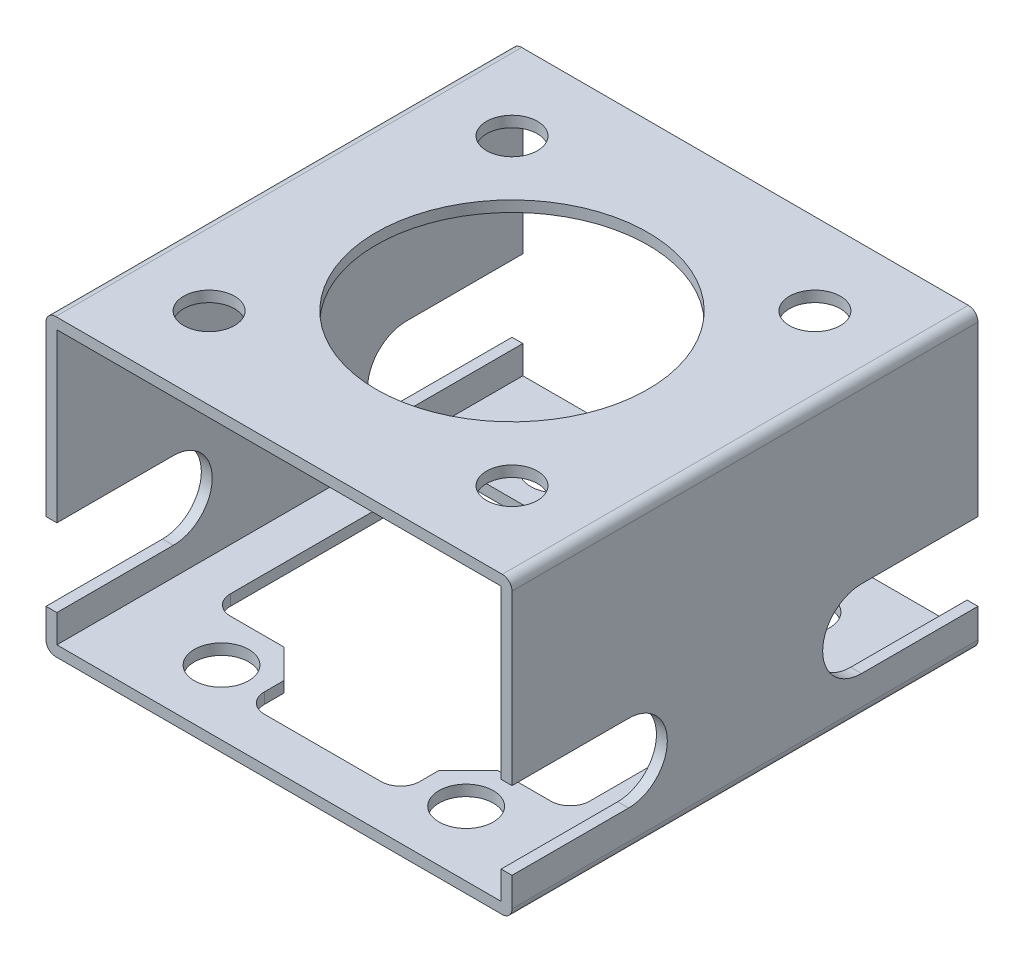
from build123d import *

# Parameters (mm, degrees)
SKETCH1_W          = 72.644
SKETCH1_H          = 44.6278
EXTRUDE1_DEPTH     = 38.1
CUT_EXTRUDE4_DEPTH = 98.876087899
SKETCH3_R          = 22.225
SKETCH3_R_2        = 4.1656
CUT_EXTRUDE5_DEPTH = 1.778
SKETCH4_R          = 4.445
CUT_EXTRUDE6_DEPTH = 1.778
CUT_EXTRUDE7_DEPTH = 1.778
FILLET1_R          = 3.175


with BuildPart() as part:
    # Sketch1 → Extrude1 (new, symmetric)
    with BuildSketch(Plane.XY):
        with BuildLine():
            Line((1.5875, 0), (74.6125, 0))
            ThreePointArc((74.6125, 0), (75.735032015, 0.464967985), (76.2, 1.5875))
            Line((76.2, 1.5875), (76.2, 46.5963))
            ThreePointArc((76.2, 46.5963), (75.735032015, 47.718832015), (74.6125, 48.1838))
            Line((74.6125, 48.1838), (1.5875, 48.1838))
            ThreePointArc((1.5875, 48.1838), (0.464967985, 47.718832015), (0, 46.5963))
            Line((0, 46.5963), (0, 1.5875))
            ThreePointArc((0, 1.5875), (0.464967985, 0.464967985), (1.5875, 0))
        make_face()
        with Locations((38.1, 24.0919)):
            Rectangle(SKETCH1_W, SKETCH1_H, mode=Mode.SUBTRACT)
    extrude(amount=EXTRUDE1_DEPTH, both=True)

    # Sketch2 → Cut-Extrude4 (cut, through all)
    with BuildSketch(Plane(origin=(0, 0, 0), x_dir=(0, 0, -1), z_dir=(1, 0, 0))):
        with BuildLine():
            Line((-38.1, 19.05), (-19.05, 19.05))
            ThreePointArc((-19.05, 19.05), (-12.7, 12.7), (-19.05, 6.35))
            Line((-19.05, 6.35), (-38.1, 6.35))
            Line((-38.1, 6.35), (-38.1, 19.05))
        make_face()
    cut_extrude4 = extrude(amount=CUT_EXTRUDE4_DEPTH, mode=Mode.SUBTRACT)

    # Mirror1: Cut-Extrude4 across plane
    add(cut_extrude4.mirror(Plane.XY), mode=Mode.SUBTRACT)

    # Sketch3 → Cut-Extrude5 (cut)
    with BuildSketch(Plane(origin=(0, 48.1838, 0), x_dir=(-1, 0, 0), z_dir=(0, 1, 0))):
        with Locations(Location((-38.1, 0, 0), (0, 0, 90))):
            Circle(SKETCH3_R)
        with Locations(Location((-13.335, -24.765, 0), (0, 0, 90))):
            Circle(SKETCH3_R_2)
        with Locations(Location((-62.865, -24.765, 0), (0, 0, 90))):
            Circle(SKETCH3_R_2)
        with Locations(Location((-62.865, 24.765, 0), (0, 0, 90))):
            Circle(SKETCH3_R_2)
        with Locations(Location((-13.335, 24.765, 0), (0, 0, 90))):
            Circle(SKETCH3_R_2)
    extrude(amount=-CUT_EXTRUDE5_DEPTH, mode=Mode.SUBTRACT)

    # Sketch4 → Cut-Extrude6 (cut)
    with BuildSketch(Plane.XZ):
        with Locations(Location((18.1, 27.5, 0), (0, 0, 270))):
            Circle(SKETCH4_R)
        with Locations(Location((58.1, 27.5, 0), (0, 0, 270))):
            Circle(SKETCH4_R)
        with Locations(Location((58.1, -27.5, 0), (0, 0, 270))):
            Circle(SKETCH4_R)
        with Locations(Location((18.1, -27.5, 0), (0, 0, 270))):
            Circle(SKETCH4_R)
    extrude(amount=-CUT_EXTRUDE6_DEPTH, mode=Mode.SUBTRACT)

    # Sketch5 → Cut-Extrude7 (cut)
    with BuildSketch(Plane.XZ):
        Polygon((8.73125, 19.84375), (20.6375, 19.84375), (25.4, 24.60625), (25.4, 30.95625), (50.8, 30.95625), (50.8, 24.60625), (55.5625, 19.84375), (67.46875, 19.84375), (67.46875, -19.84375), (55.5625, -19.84375), (50.8, -24.60625), (50.8, -30.95625), (25.4, -30.95625), (25.4, -24.60625), (20.6375, -19.84375), (8.73125, -19.84375), align=None)
    extrude(amount=-CUT_EXTRUDE7_DEPTH, mode=Mode.SUBTRACT)

    # Fillet1
    fillet1_edges = [part.edges().sort_by_distance(p)[0] for p in [
        (25.4, 0.889, 30.95625),
        (50.8, 0.889, 30.95625),
        (67.46875, 0.889, 19.84375),
        (67.46875, 0.889, -19.84375),
        (50.8, 0.889, -30.95625),
        (25.4, 0.889, -30.95625),
        (8.73125, 0.889, -19.84375),
        (8.73125, 0.889, 19.84375),
    ]]
    fillet(fillet1_edges, radius=FILLET1_R)


solid = part.part
